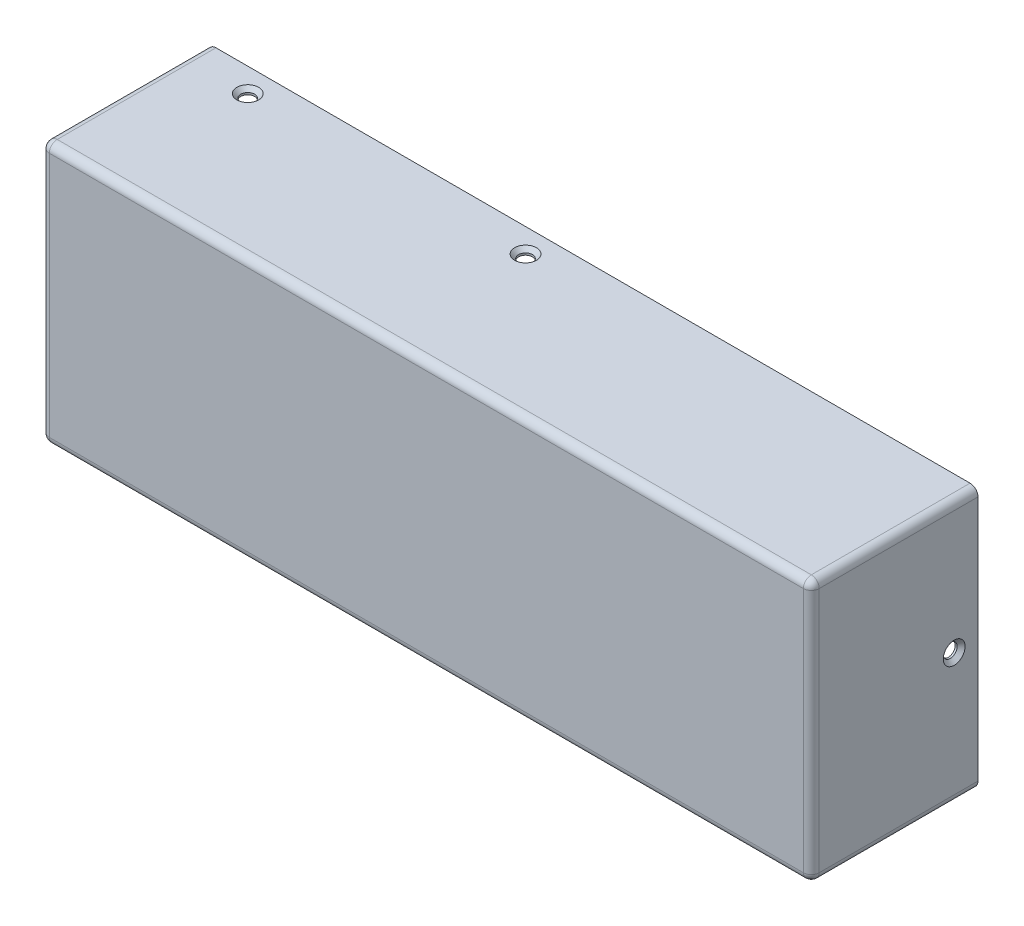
ISO-10303-21;
HEADER;
FILE_DESCRIPTION(('STEP AP214'),'2;1');
FILE_NAME('part.step','',(''),(''),'','','');
FILE_SCHEMA(('AUTOMOTIVE_DESIGN { 1 0 10303 214 1 1 1 1 }'));
ENDSEC;
DATA;
#1=APPLICATION_CONTEXT('core data for automotive mechanical design processes');
#2=APPLICATION_PROTOCOL_DEFINITION('international standard','automotive_design',2000,#1);
#3=PRODUCT_CONTEXT('',#1,'mechanical');
#4=PRODUCT('Part','Part','',(#3));
#5=PRODUCT_RELATED_PRODUCT_CATEGORY('part','',(#4));
#6=PRODUCT_DEFINITION_FORMATION('','',#4);
#7=PRODUCT_DEFINITION_CONTEXT('part definition',#1,'design');
#8=PRODUCT_DEFINITION('design','',#6,#7);
#9=PRODUCT_DEFINITION_SHAPE('','',#8);
#10=(LENGTH_UNIT() NAMED_UNIT(*) SI_UNIT(.MILLI.,.METRE.));
#11=(NAMED_UNIT(*) PLANE_ANGLE_UNIT() SI_UNIT($,.RADIAN.));
#12=(NAMED_UNIT(*) SI_UNIT($,.STERADIAN.) SOLID_ANGLE_UNIT());
#13=UNCERTAINTY_MEASURE_WITH_UNIT(LENGTH_MEASURE(1.E-05),#10,'distance_accuracy_value','');
#14=(GEOMETRIC_REPRESENTATION_CONTEXT(3) GLOBAL_UNCERTAINTY_ASSIGNED_CONTEXT((#13)) GLOBAL_UNIT_ASSIGNED_CONTEXT((#10,
#11,#12)) REPRESENTATION_CONTEXT('',''));
#15=CARTESIAN_POINT('',(0.,0.,0.));
#16=DIRECTION('',(0.,0.,1.));
#17=DIRECTION('',(1.,0.,0.));
#18=AXIS2_PLACEMENT_3D('',#15,#16,#17);
#19=CARTESIAN_POINT('',(46.8344074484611,55.7007394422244,39.9999999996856));
#20=DIRECTION('',(0.,-1.,0.));
#21=DIRECTION('',(0.,0.,-1.));
#22=AXIS2_PLACEMENT_3D('',#19,#20,#21);
#23=CIRCLE('',#22,0.5);
#24=TRIMMED_CURVE('',#23,(PARAMETER_VALUE(1.07767927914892E-09)),
(PARAMETER_VALUE(3.14159265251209)),.T.,.PARAMETER.);
#25=CARTESIAN_POINT('',(46.834407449,55.700739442,40.));
#26=DIRECTION('',(0.,0.,1.));
#27=AXIS1_PLACEMENT('',#25,#26);
#28=SURFACE_OF_REVOLUTION('',#24,#27);
#29=CARTESIAN_POINT('',(46.834407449,55.700739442,40.));
#30=DIRECTION('',(1.,0.,0.));
#31=DIRECTION('',(0.,0.,-1.));
#32=AXIS2_PLACEMENT_3D('',#29,#30,#31);
#33=CIRCLE('',#32,0.5);
#34=CARTESIAN_POINT('',(46.834407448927,55.7007394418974,40.5));
#35=VERTEX_POINT('',#34);
#36=CARTESIAN_POINT('',(46.834407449,56.200739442,40.0000000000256));
#37=VERTEX_POINT('',#36);
#38=EDGE_CURVE('E164',#35,#37,#33,.F.);
#39=ORIENTED_EDGE('',*,*,#38,.F.);
#40=CARTESIAN_POINT('',(46.834407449,55.700739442,40.));
#41=DIRECTION('',(0.,1.,0.));
#42=DIRECTION('',(0.,0.,1.));
#43=AXIS2_PLACEMENT_3D('',#40,#41,#42);
#44=CIRCLE('',#43,0.5);
#45=CARTESIAN_POINT('',(46.334407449,55.700739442,40.));
#46=VERTEX_POINT('',#45);
#47=EDGE_CURVE('E580',#46,#35,#44,.T.);
#48=ORIENTED_EDGE('',*,*,#47,.F.);
#49=CARTESIAN_POINT('',(46.834407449,55.700739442,40.));
#50=DIRECTION('',(0.,0.,-1.));
#51=DIRECTION('',(-1.,0.,0.));
#52=AXIS2_PLACEMENT_3D('',#49,#50,#51);
#53=CIRCLE('',#52,0.5);
#54=EDGE_CURVE('E163',#37,#46,#53,.F.);
#55=ORIENTED_EDGE('',*,*,#54,.F.);
#56=EDGE_LOOP('',(#39,#48,#55));
#57=FACE_BOUND('',#56,.T.);
#58=ADVANCED_FACE('F17',(#57),#28,.F.);
#59=CARTESIAN_POINT('',(46.8344074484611,-6.2992605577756,39.9999999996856));
#60=DIRECTION('',(0.,-1.,0.));
#61=DIRECTION('',(0.,0.,-1.));
#62=AXIS2_PLACEMENT_3D('',#59,#60,#61);
#63=CIRCLE('',#62,0.5);
#64=TRIMMED_CURVE('',#63,(PARAMETER_VALUE(1.07765174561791E-09)),
(PARAMETER_VALUE(3.14159265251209)),.T.,.PARAMETER.);
#65=CARTESIAN_POINT('',(46.834407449,-6.299260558,40.));
#66=DIRECTION('',(0.,0.,1.));
#67=AXIS1_PLACEMENT('',#65,#66);
#68=SURFACE_OF_REVOLUTION('',#64,#67);
#69=CARTESIAN_POINT('',(46.834407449,-6.299260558,40.));
#70=DIRECTION('',(0.,1.,0.));
#71=DIRECTION('',(0.,0.,1.));
#72=AXIS2_PLACEMENT_3D('',#69,#70,#71);
#73=CIRCLE('',#72,0.5);
#74=CARTESIAN_POINT('',(46.8344074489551,-6.2992605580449,40.5));
#75=VERTEX_POINT('',#74);
#76=CARTESIAN_POINT('',(46.334407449,-6.29926055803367,39.9999999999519));
#77=VERTEX_POINT('',#76);
#78=EDGE_CURVE('E578',#75,#77,#73,.F.);
#79=ORIENTED_EDGE('',*,*,#78,.F.);
#80=CARTESIAN_POINT('',(46.834407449,-6.299260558,40.));
#81=DIRECTION('',(-1.,0.,0.));
#82=DIRECTION('',(0.,0.,1.));
#83=AXIS2_PLACEMENT_3D('',#80,#81,#82);
#84=CIRCLE('',#83,0.5);
#85=CARTESIAN_POINT('',(46.834407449,-6.799260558,39.9999999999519));
#86=VERTEX_POINT('',#85);
#87=EDGE_CURVE('E407',#86,#75,#84,.T.);
#88=ORIENTED_EDGE('',*,*,#87,.F.);
#89=CARTESIAN_POINT('',(46.834407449,-6.299260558,40.));
#90=DIRECTION('',(0.,0.,-1.));
#91=DIRECTION('',(-1.,0.,0.));
#92=AXIS2_PLACEMENT_3D('',#89,#90,#91);
#93=CIRCLE('',#92,0.5);
#94=EDGE_CURVE('E401',#77,#86,#93,.F.);
#95=ORIENTED_EDGE('',*,*,#94,.F.);
#96=EDGE_LOOP('',(#79,#88,#95));
#97=FACE_BOUND('',#96,.T.);
#98=ADVANCED_FACE('F383',(#97),#68,.F.);
#99=CARTESIAN_POINT('',(46.834407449,-6.299260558,40.5));
#100=DIRECTION('',(0.,0.,1.));
#101=DIRECTION('',(1.,0.,0.));
#102=AXIS2_PLACEMENT_3D('',#99,#100,#101);
#103=PLANE('',#102);
#104=DIRECTION('',(-1.,0.,0.));
#105=VECTOR('',#104,1.);
#106=CARTESIAN_POINT('',(141.834407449,-6.29926055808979,40.5));
#107=LINE('',#106,#105);
#108=CARTESIAN_POINT('',(236.834407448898,-6.2992605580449,40.5));
#109=VERTEX_POINT('',#108);
#110=EDGE_CURVE('E404',#75,#109,#107,.F.);
#111=ORIENTED_EDGE('',*,*,#110,.F.);
#112=DIRECTION('',(0.,1.,0.));
#113=VECTOR('',#112,1.);
#114=CARTESIAN_POINT('',(46.8344074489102,24.700739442,40.5));
#115=LINE('',#114,#113);
#116=EDGE_CURVE('E582',#35,#75,#115,.F.);
#117=ORIENTED_EDGE('',*,*,#116,.F.);
#118=DIRECTION('',(1.,0.,0.));
#119=VECTOR('',#118,1.);
#120=CARTESIAN_POINT('',(141.834407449,55.7007394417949,40.5));
#121=LINE('',#120,#119);
#122=CARTESIAN_POINT('',(236.834407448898,55.7007394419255,40.5));
#123=VERTEX_POINT('',#122);
#124=EDGE_CURVE('E418',#123,#35,#121,.F.);
#125=ORIENTED_EDGE('',*,*,#124,.F.);
#126=DIRECTION('',(0.,-1.,0.));
#127=VECTOR('',#126,1.);
#128=CARTESIAN_POINT('',(236.834407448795,24.700739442,40.5));
#129=LINE('',#128,#127);
#130=EDGE_CURVE('E388',#109,#123,#129,.F.);
#131=ORIENTED_EDGE('',*,*,#130,.F.);
#132=EDGE_LOOP('',(#111,#117,#125,#131));
#133=FACE_BOUND('',#132,.T.);
#134=ADVANCED_FACE('F381',(#133),#103,.F.);
#135=CARTESIAN_POINT('',(236.834407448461,55.7007394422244,39.9999999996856));
#136=DIRECTION('',(0.,-1.,0.));
#137=DIRECTION('',(0.,0.,-1.));
#138=AXIS2_PLACEMENT_3D('',#135,#136,#137);
#139=CIRCLE('',#138,0.5);
#140=TRIMMED_CURVE('',#139,(PARAMETER_VALUE(1.07747144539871E-09)),
(PARAMETER_VALUE(3.14159265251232)),.T.,.PARAMETER.);
#141=CARTESIAN_POINT('',(236.834407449,55.700739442,40.));
#142=DIRECTION('',(0.,0.,1.));
#143=AXIS1_PLACEMENT('',#141,#142);
#144=SURFACE_OF_REVOLUTION('',#140,#143);
#145=CARTESIAN_POINT('',(236.834407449,55.700739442,40.));
#146=DIRECTION('',(1.,0.,0.));
#147=DIRECTION('',(0.,0.,-1.));
#148=AXIS2_PLACEMENT_3D('',#145,#146,#147);
#149=CIRCLE('',#148,0.5);
#150=CARTESIAN_POINT('',(236.834407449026,56.200739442,40.));
#151=VERTEX_POINT('',#150);
#152=EDGE_CURVE('E568',#151,#123,#149,.T.);
#153=ORIENTED_EDGE('',*,*,#152,.F.);
#154=CARTESIAN_POINT('',(236.834407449,55.700739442,40.));
#155=DIRECTION('',(0.,0.,-1.));
#156=DIRECTION('',(-1.,0.,0.));
#157=AXIS2_PLACEMENT_3D('',#154,#155,#156);
#158=CIRCLE('',#157,0.5);
#159=CARTESIAN_POINT('',(237.334407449,55.700739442,40.0000000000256));
#160=VERTEX_POINT('',#159);
#161=EDGE_CURVE('E543',#160,#151,#158,.F.);
#162=ORIENTED_EDGE('',*,*,#161,.F.);
#163=CARTESIAN_POINT('',(236.834407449,55.700739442,40.));
#164=DIRECTION('',(0.,-1.,0.));
#165=DIRECTION('',(0.,0.,-1.));
#166=AXIS2_PLACEMENT_3D('',#163,#164,#165);
#167=CIRCLE('',#166,0.5);
#168=EDGE_CURVE('E391',#123,#160,#167,.F.);
#169=ORIENTED_EDGE('',*,*,#168,.F.);
#170=EDGE_LOOP('',(#153,#162,#169));
#171=FACE_BOUND('',#170,.T.);
#172=ADVANCED_FACE('F377',(#171),#144,.F.);
#173=CARTESIAN_POINT('',(236.834407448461,-6.29926055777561,39.9999999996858));
#174=DIRECTION('',(0.,-1.,0.));
#175=DIRECTION('',(0.,0.,-1.));
#176=AXIS2_PLACEMENT_3D('',#173,#174,#175);
#177=CIRCLE('',#176,0.5);
#178=TRIMMED_CURVE('',#177,(PARAMETER_VALUE(1.07747144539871E-09)),
(PARAMETER_VALUE(3.14159265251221)),.T.,.PARAMETER.);
#179=CARTESIAN_POINT('',(236.834407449,-6.299260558,40.));
#180=DIRECTION('',(0.,0.,1.));
#181=AXIS1_PLACEMENT('',#179,#180);
#182=SURFACE_OF_REVOLUTION('',#178,#181);
#183=CARTESIAN_POINT('',(236.834407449,-6.299260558,40.));
#184=DIRECTION('',(0.,-1.,0.));
#185=DIRECTION('',(0.,0.,-1.));
#186=AXIS2_PLACEMENT_3D('',#183,#184,#185);
#187=CIRCLE('',#186,0.5);
#188=CARTESIAN_POINT('',(237.334407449,-6.299260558,40.0000000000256));
#189=VERTEX_POINT('',#188);
#190=EDGE_CURVE('E392',#189,#109,#187,.T.);
#191=ORIENTED_EDGE('',*,*,#190,.F.);
#192=CARTESIAN_POINT('',(236.834407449,-6.299260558,40.));
#193=DIRECTION('',(0.,0.,-1.));
#194=DIRECTION('',(-1.,0.,0.));
#195=AXIS2_PLACEMENT_3D('',#192,#193,#194);
#196=CIRCLE('',#195,0.5);
#197=CARTESIAN_POINT('',(236.834407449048,-6.799260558,39.9999999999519));
#198=VERTEX_POINT('',#197);
#199=EDGE_CURVE('E542',#198,#189,#196,.F.);
#200=ORIENTED_EDGE('',*,*,#199,.F.);
#201=CARTESIAN_POINT('',(236.834407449,-6.299260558,40.));
#202=DIRECTION('',(-1.,0.,0.));
#203=DIRECTION('',(0.,0.,1.));
#204=AXIS2_PLACEMENT_3D('',#201,#202,#203);
#205=CIRCLE('',#204,0.5);
#206=EDGE_CURVE('E406',#109,#198,#205,.F.);
#207=ORIENTED_EDGE('',*,*,#206,.F.);
#208=EDGE_LOOP('',(#191,#200,#207));
#209=FACE_BOUND('',#208,.T.);
#210=ADVANCED_FACE('F373',(#209),#182,.F.);
#211=CARTESIAN_POINT('',(130.834407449,56.700739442,6.));
#212=DIRECTION('',(0.,1.,0.));
#213=DIRECTION('',(0.,0.,1.));
#214=AXIS2_PLACEMENT_3D('',#211,#212,#213);
#215=CONICAL_SURFACE('',#214,1.75,0.785398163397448);
#216=CARTESIAN_POINT('',(130.834407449,57.7007394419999,6.));
#217=DIRECTION('',(0.,1.,0.));
#218=DIRECTION('',(0.,0.,1.));
#219=AXIS2_PLACEMENT_3D('',#216,#217,#218);
#220=CIRCLE('',#219,2.74999999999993);
#221=CARTESIAN_POINT('',(130.834407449,57.7007394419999,8.74999999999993));
#222=VERTEX_POINT('',#221);
#223=EDGE_CURVE('E536',#222,#222,#220,.T.);
#224=ORIENTED_EDGE('',*,*,#223,.T.);
#225=EDGE_LOOP('',(#224));
#226=FACE_BOUND('',#225,.T.);
#227=CARTESIAN_POINT('',(130.834407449,56.700739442,6.));
#228=DIRECTION('',(0.,1.,0.));
#229=DIRECTION('',(0.,0.,1.));
#230=AXIS2_PLACEMENT_3D('',#227,#228,#229);
#231=CIRCLE('',#230,1.75);
#232=CARTESIAN_POINT('',(130.834407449,56.700739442,7.75));
#233=VERTEX_POINT('',#232);
#234=EDGE_CURVE('E413',#233,#233,#231,.T.);
#235=ORIENTED_EDGE('',*,*,#234,.F.);
#236=EDGE_LOOP('',(#235));
#237=FACE_BOUND('',#236,.T.);
#238=ADVANCED_FACE('F369',(#226,#237),#215,.F.);
#239=CARTESIAN_POINT('',(60.834407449,56.700739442,6.));
#240=DIRECTION('',(0.,1.,0.));
#241=DIRECTION('',(0.,0.,1.));
#242=AXIS2_PLACEMENT_3D('',#239,#240,#241);
#243=CONICAL_SURFACE('',#242,1.75,0.785398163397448);
#244=CARTESIAN_POINT('',(60.834407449,57.7007394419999,6.));
#245=DIRECTION('',(0.,1.,0.));
#246=DIRECTION('',(0.,0.,1.));
#247=AXIS2_PLACEMENT_3D('',#244,#245,#246);
#248=CIRCLE('',#247,2.74999999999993);
#249=CARTESIAN_POINT('',(60.834407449,57.7007394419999,8.74999999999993));
#250=VERTEX_POINT('',#249);
#251=EDGE_CURVE('E533',#250,#250,#248,.T.);
#252=ORIENTED_EDGE('',*,*,#251,.T.);
#253=EDGE_LOOP('',(#252));
#254=FACE_BOUND('',#253,.T.);
#255=CARTESIAN_POINT('',(60.834407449,56.700739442,6.));
#256=DIRECTION('',(0.,1.,0.));
#257=DIRECTION('',(0.,0.,1.));
#258=AXIS2_PLACEMENT_3D('',#255,#256,#257);
#259=CIRCLE('',#258,1.75);
#260=CARTESIAN_POINT('',(60.834407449,56.700739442,7.75));
#261=VERTEX_POINT('',#260);
#262=EDGE_CURVE('E410',#261,#261,#259,.T.);
#263=ORIENTED_EDGE('',*,*,#262,.F.);
#264=EDGE_LOOP('',(#263));
#265=FACE_BOUND('',#264,.T.);
#266=ADVANCED_FACE('F365',(#254,#265),#243,.F.);
#267=CARTESIAN_POINT('',(46.8344074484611,55.7007394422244,39.9999999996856));
#268=DIRECTION('',(0.,0.,1.));
#269=DIRECTION('',(-1.,0.,0.));
#270=AXIS2_PLACEMENT_3D('',#267,#268,#269);
#271=SPHERICAL_SURFACE('',#270,2.);
#272=CARTESIAN_POINT('',(46.834407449,55.700739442,40.));
#273=DIRECTION('',(0.,1.,0.));
#274=DIRECTION('',(0.,0.,1.));
#275=AXIS2_PLACEMENT_3D('',#272,#273,#274);
#276=CIRCLE('',#275,2.);
#277=CARTESIAN_POINT('',(44.834407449,55.700739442,39.9999999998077));
#278=VERTEX_POINT('',#277);
#279=CARTESIAN_POINT('',(46.834407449,55.7007394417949,42.));
#280=VERTEX_POINT('',#279);
#281=EDGE_CURVE('E398',#278,#280,#276,.T.);
#282=ORIENTED_EDGE('',*,*,#281,.T.);
#283=CARTESIAN_POINT('',(46.834407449,55.700739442,40.));
#284=DIRECTION('',(1.,0.,0.));
#285=DIRECTION('',(0.,0.,-1.));
#286=AXIS2_PLACEMENT_3D('',#283,#284,#285);
#287=CIRCLE('',#286,2.);
#288=CARTESIAN_POINT('',(46.8344074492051,57.700739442,40.0000000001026));
#289=VERTEX_POINT('',#288);
#290=EDGE_CURVE('E656',#280,#289,#287,.F.);
#291=ORIENTED_EDGE('',*,*,#290,.T.);
#292=CARTESIAN_POINT('',(46.834407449,55.700739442,40.));
#293=DIRECTION('',(0.,0.,-1.));
#294=DIRECTION('',(-1.,0.,0.));
#295=AXIS2_PLACEMENT_3D('',#292,#293,#294);
#296=CIRCLE('',#295,2.);
#297=EDGE_CURVE('E352',#289,#278,#296,.F.);
#298=ORIENTED_EDGE('',*,*,#297,.T.);
#299=EDGE_LOOP('',(#282,#291,#298));
#300=FACE_BOUND('',#299,.T.);
#301=ADVANCED_FACE('F362',(#300),#271,.T.);
#302=CARTESIAN_POINT('',(45.834407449,24.700739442,6.));
#303=DIRECTION('',(-1.,0.,0.));
#304=DIRECTION('',(0.,-1.,0.));
#305=AXIS2_PLACEMENT_3D('',#302,#303,#304);
#306=CONICAL_SURFACE('',#305,1.75,0.785398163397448);
#307=CARTESIAN_POINT('',(44.834407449,24.700739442,6.));
#308=DIRECTION('',(-1.,0.,0.));
#309=DIRECTION('',(0.,-1.,0.));
#310=AXIS2_PLACEMENT_3D('',#307,#308,#309);
#311=CIRCLE('',#310,2.74999999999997);
#312=CARTESIAN_POINT('',(44.834407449,21.950739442,6.));
#313=VERTEX_POINT('',#312);
#314=EDGE_CURVE('E348',#313,#313,#311,.T.);
#315=ORIENTED_EDGE('',*,*,#314,.T.);
#316=EDGE_LOOP('',(#315));
#317=FACE_BOUND('',#316,.T.);
#318=CARTESIAN_POINT('',(45.834407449,24.700739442,6.));
#319=DIRECTION('',(1.,0.,0.));
#320=DIRECTION('',(0.,0.,-1.));
#321=AXIS2_PLACEMENT_3D('',#318,#319,#320);
#322=CIRCLE('',#321,1.75);
#323=CARTESIAN_POINT('',(45.834407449,24.700739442,4.25));
#324=VERTEX_POINT('',#323);
#325=EDGE_CURVE('E570',#324,#324,#322,.F.);
#326=ORIENTED_EDGE('',*,*,#325,.F.);
#327=EDGE_LOOP('',(#326));
#328=FACE_BOUND('',#327,.T.);
#329=ADVANCED_FACE('F337',(#317,#328),#306,.F.);
#330=CARTESIAN_POINT('',(46.8344074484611,-6.2992605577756,39.9999999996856));
#331=DIRECTION('',(0.,0.,1.));
#332=DIRECTION('',(-1.,0.,0.));
#333=AXIS2_PLACEMENT_3D('',#330,#331,#332);
#334=SPHERICAL_SURFACE('',#333,2.);
#335=CARTESIAN_POINT('',(46.834407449,-6.299260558,40.));
#336=DIRECTION('',(-1.,0.,0.));
#337=DIRECTION('',(0.,0.,1.));
#338=AXIS2_PLACEMENT_3D('',#335,#336,#337);
#339=CIRCLE('',#338,2.);
#340=CARTESIAN_POINT('',(46.8344074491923,-8.299260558,39.9999999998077));
#341=VERTEX_POINT('',#340);
#342=CARTESIAN_POINT('',(46.8344074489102,-6.299260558,42.));
#343=VERTEX_POINT('',#342);
#344=EDGE_CURVE('E648',#341,#343,#339,.T.);
#345=ORIENTED_EDGE('',*,*,#344,.T.);
#346=CARTESIAN_POINT('',(46.834407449,-6.299260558,40.));
#347=DIRECTION('',(0.,1.,0.));
#348=DIRECTION('',(0.,0.,1.));
#349=AXIS2_PLACEMENT_3D('',#346,#347,#348);
#350=CIRCLE('',#349,2.);
#351=CARTESIAN_POINT('',(44.834407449,-6.29926055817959,39.9999999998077));
#352=VERTEX_POINT('',#351);
#353=EDGE_CURVE('E665',#343,#352,#350,.F.);
#354=ORIENTED_EDGE('',*,*,#353,.T.);
#355=CARTESIAN_POINT('',(46.834407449,-6.299260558,40.));
#356=DIRECTION('',(0.,0.,-1.));
#357=DIRECTION('',(-1.,0.,0.));
#358=AXIS2_PLACEMENT_3D('',#355,#356,#357);
#359=CIRCLE('',#358,2.);
#360=EDGE_CURVE('E609',#352,#341,#359,.F.);
#361=ORIENTED_EDGE('',*,*,#360,.T.);
#362=EDGE_LOOP('',(#345,#354,#361));
#363=FACE_BOUND('',#362,.T.);
#364=ADVANCED_FACE('F332',(#363),#334,.T.);
#365=CARTESIAN_POINT('',(46.834407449,-6.299260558,40.));
#366=DIRECTION('',(0.,1.,0.));
#367=DIRECTION('',(0.,0.,1.));
#368=AXIS2_PLACEMENT_3D('',#365,#366,#367);
#369=CYLINDRICAL_SURFACE('',#368,0.5);
#370=ORIENTED_EDGE('',*,*,#47,.T.);
#371=ORIENTED_EDGE('',*,*,#116,.T.);
#372=ORIENTED_EDGE('',*,*,#78,.T.);
#373=DIRECTION('',(0.,-1.,0.));
#374=VECTOR('',#373,1.);
#375=CARTESIAN_POINT('',(46.334407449,24.700739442,40.));
#376=LINE('',#375,#374);
#377=EDGE_CURVE('E573',#46,#77,#376,.T.);
#378=ORIENTED_EDGE('',*,*,#377,.F.);
#379=EDGE_LOOP('',(#370,#371,#372,#378));
#380=FACE_BOUND('',#379,.T.);
#381=ADVANCED_FACE('F328',(#380),#369,.F.);
#382=CARTESIAN_POINT('',(45.834407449,24.700739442,6.));
#383=DIRECTION('',(1.,0.,0.));
#384=DIRECTION('',(0.,1.,0.));
#385=AXIS2_PLACEMENT_3D('',#382,#383,#384);
#386=CYLINDRICAL_SURFACE('',#385,1.75);
#387=CARTESIAN_POINT('',(46.334407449,24.700739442,6.));
#388=DIRECTION('',(1.,0.,0.));
#389=DIRECTION('',(0.,1.,0.));
#390=AXIS2_PLACEMENT_3D('',#387,#388,#389);
#391=CIRCLE('',#390,1.75);
#392=CARTESIAN_POINT('',(46.334407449,26.450739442,6.));
#393=VERTEX_POINT('',#392);
#394=EDGE_CURVE('E525',#393,#393,#391,.F.);
#395=ORIENTED_EDGE('',*,*,#394,.F.);
#396=EDGE_LOOP('',(#395));
#397=FACE_BOUND('',#396,.T.);
#398=ORIENTED_EDGE('',*,*,#325,.T.);
#399=EDGE_LOOP('',(#398));
#400=FACE_BOUND('',#399,.T.);
#401=ADVANCED_FACE('F324',(#397,#400),#386,.F.);
#402=CARTESIAN_POINT('',(46.834407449,55.700739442,40.));
#403=DIRECTION('',(1.,0.,0.));
#404=DIRECTION('',(0.,0.,-1.));
#405=AXIS2_PLACEMENT_3D('',#402,#403,#404);
#406=CYLINDRICAL_SURFACE('',#405,0.5);
#407=ORIENTED_EDGE('',*,*,#38,.T.);
#408=DIRECTION('',(-1.,0.,0.));
#409=VECTOR('',#408,1.);
#410=CARTESIAN_POINT('',(141.834407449,56.200739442,40.));
#411=LINE('',#410,#409);
#412=EDGE_CURVE('E172',#151,#37,#411,.T.);
#413=ORIENTED_EDGE('',*,*,#412,.F.);
#414=ORIENTED_EDGE('',*,*,#152,.T.);
#415=ORIENTED_EDGE('',*,*,#124,.T.);
#416=EDGE_LOOP('',(#407,#413,#414,#415));
#417=FACE_BOUND('',#416,.T.);
#418=ADVANCED_FACE('F321',(#417),#406,.F.);
#419=CARTESIAN_POINT('',(46.834407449,55.700739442,40.));
#420=DIRECTION('',(0.,0.,-1.));
#421=DIRECTION('',(0.,1.,0.));
#422=AXIS2_PLACEMENT_3D('',#419,#420,#421);
#423=CYLINDRICAL_SURFACE('',#422,0.5);
#424=ORIENTED_EDGE('',*,*,#54,.T.);
#425=DIRECTION('',(0.,0.,1.));
#426=VECTOR('',#425,1.);
#427=CARTESIAN_POINT('',(46.334407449,55.700739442,20.));
#428=LINE('',#427,#426);
#429=CARTESIAN_POINT('',(46.334407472,55.7007394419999,0.));
#430=VERTEX_POINT('',#429);
#431=EDGE_CURVE('E161',#430,#46,#428,.T.);
#432=ORIENTED_EDGE('',*,*,#431,.F.);
#433=CARTESIAN_POINT('',(46.834407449,55.7007394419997,0.));
#434=DIRECTION('',(0.,0.,-1.));
#435=DIRECTION('',(0.,1.,0.));
#436=AXIS2_PLACEMENT_3D('',#433,#434,#435);
#437=CIRCLE('',#436,0.5);
#438=CARTESIAN_POINT('',(46.834407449,56.200739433,0.));
#439=VERTEX_POINT('',#438);
#440=EDGE_CURVE('E21',#430,#439,#437,.T.);
#441=ORIENTED_EDGE('',*,*,#440,.T.);
#442=DIRECTION('',(0.,0.,-1.));
#443=VECTOR('',#442,1.);
#444=CARTESIAN_POINT('',(46.834407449,56.200739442,20.));
#445=LINE('',#444,#443);
#446=EDGE_CURVE('E159',#37,#439,#445,.T.);
#447=ORIENTED_EDGE('',*,*,#446,.F.);
#448=EDGE_LOOP('',(#424,#432,#441,#447));
#449=FACE_BOUND('',#448,.T.);
#450=ADVANCED_FACE('F158',(#449),#423,.F.);
#451=CARTESIAN_POINT('',(130.834407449,56.200739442,6.));
#452=DIRECTION('',(0.,1.,0.));
#453=DIRECTION('',(-1.,0.,0.));
#454=AXIS2_PLACEMENT_3D('',#451,#452,#453);
#455=CYLINDRICAL_SURFACE('',#454,1.75);
#456=CARTESIAN_POINT('',(130.834407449,56.200739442,6.));
#457=DIRECTION('',(0.,1.,0.));
#458=DIRECTION('',(-1.,0.,0.));
#459=AXIS2_PLACEMENT_3D('',#456,#457,#458);
#460=CIRCLE('',#459,1.75);
#461=CARTESIAN_POINT('',(129.084407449,56.200739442,6.));
#462=VERTEX_POINT('',#461);
#463=EDGE_CURVE('E174',#462,#462,#460,.T.);
#464=ORIENTED_EDGE('',*,*,#463,.F.);
#465=EDGE_LOOP('',(#464));
#466=FACE_BOUND('',#465,.T.);
#467=ORIENTED_EDGE('',*,*,#234,.T.);
#468=EDGE_LOOP('',(#467));
#469=FACE_BOUND('',#468,.T.);
#470=ADVANCED_FACE('F314',(#466,#469),#455,.F.);
#471=CARTESIAN_POINT('',(60.834407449,56.200739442,6.));
#472=DIRECTION('',(0.,1.,0.));
#473=DIRECTION('',(-1.,0.,0.));
#474=AXIS2_PLACEMENT_3D('',#471,#472,#473);
#475=CYLINDRICAL_SURFACE('',#474,1.75);
#476=CARTESIAN_POINT('',(60.834407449,56.200739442,6.));
#477=DIRECTION('',(0.,1.,0.));
#478=DIRECTION('',(-1.,0.,0.));
#479=AXIS2_PLACEMENT_3D('',#476,#477,#478);
#480=CIRCLE('',#479,1.75);
#481=CARTESIAN_POINT('',(59.084407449,56.200739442,6.));
#482=VERTEX_POINT('',#481);
#483=EDGE_CURVE('E519',#482,#482,#480,.T.);
#484=ORIENTED_EDGE('',*,*,#483,.F.);
#485=EDGE_LOOP('',(#484));
#486=FACE_BOUND('',#485,.T.);
#487=ORIENTED_EDGE('',*,*,#262,.T.);
#488=EDGE_LOOP('',(#487));
#489=FACE_BOUND('',#488,.T.);
#490=ADVANCED_FACE('F310',(#486,#489),#475,.F.);
#491=CARTESIAN_POINT('',(236.834407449,-6.299260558,40.));
#492=DIRECTION('',(-1.,0.,0.));
#493=DIRECTION('',(0.,0.,1.));
#494=AXIS2_PLACEMENT_3D('',#491,#492,#493);
#495=CYLINDRICAL_SURFACE('',#494,0.5);
#496=ORIENTED_EDGE('',*,*,#206,.T.);
#497=DIRECTION('',(1.,0.,0.));
#498=VECTOR('',#497,1.);
#499=CARTESIAN_POINT('',(141.834407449,-6.799260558,40.));
#500=LINE('',#499,#498);
#501=EDGE_CURVE('E522',#86,#198,#500,.T.);
#502=ORIENTED_EDGE('',*,*,#501,.F.);
#503=ORIENTED_EDGE('',*,*,#87,.T.);
#504=ORIENTED_EDGE('',*,*,#110,.T.);
#505=EDGE_LOOP('',(#496,#502,#503,#504));
#506=FACE_BOUND('',#505,.T.);
#507=ADVANCED_FACE('F306',(#506),#495,.F.);
#508=CARTESIAN_POINT('',(46.834407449,-6.299260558,40.));
#509=DIRECTION('',(0.,0.,-1.));
#510=DIRECTION('',(0.,1.,0.));
#511=AXIS2_PLACEMENT_3D('',#508,#509,#510);
#512=CYLINDRICAL_SURFACE('',#511,0.5);
#513=ORIENTED_EDGE('',*,*,#94,.T.);
#514=DIRECTION('',(0.,0.,1.));
#515=VECTOR('',#514,1.);
#516=CARTESIAN_POINT('',(46.834407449,-6.799260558,20.));
#517=LINE('',#516,#515);
#518=CARTESIAN_POINT('',(46.834407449,-6.799260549,0.));
#519=VERTEX_POINT('',#518);
#520=EDGE_CURVE('E518',#519,#86,#517,.T.);
#521=ORIENTED_EDGE('',*,*,#520,.F.);
#522=CARTESIAN_POINT('',(46.834407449,-6.29926055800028,0.));
#523=DIRECTION('',(0.,0.,-1.));
#524=DIRECTION('',(0.,1.,0.));
#525=AXIS2_PLACEMENT_3D('',#522,#523,#524);
#526=CIRCLE('',#525,0.5);
#527=CARTESIAN_POINT('',(46.334407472,-6.29926055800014,0.));
#528=VERTEX_POINT('',#527);
#529=EDGE_CURVE('E544',#519,#528,#526,.T.);
#530=ORIENTED_EDGE('',*,*,#529,.T.);
#531=DIRECTION('',(0.,0.,-1.));
#532=VECTOR('',#531,1.);
#533=CARTESIAN_POINT('',(46.334407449,-6.299260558,20.));
#534=LINE('',#533,#532);
#535=EDGE_CURVE('E529',#77,#528,#534,.T.);
#536=ORIENTED_EDGE('',*,*,#535,.F.);
#537=EDGE_LOOP('',(#513,#521,#530,#536));
#538=FACE_BOUND('',#537,.T.);
#539=ADVANCED_FACE('F302',(#538),#512,.F.);
#540=CARTESIAN_POINT('',(130.834407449,-7.299260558,6.));
#541=DIRECTION('',(0.,1.,0.));
#542=DIRECTION('',(-1.,0.,0.));
#543=AXIS2_PLACEMENT_3D('',#540,#541,#542);
#544=CYLINDRICAL_SURFACE('',#543,1.75);
#545=CARTESIAN_POINT('',(130.834407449,-6.799260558,6.));
#546=DIRECTION('',(0.,1.,0.));
#547=DIRECTION('',(-1.,0.,0.));
#548=AXIS2_PLACEMENT_3D('',#545,#546,#547);
#549=CIRCLE('',#548,1.75);
#550=CARTESIAN_POINT('',(129.084407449,-6.799260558,6.));
#551=VERTEX_POINT('',#550);
#552=EDGE_CURVE('E515',#551,#551,#549,.F.);
#553=ORIENTED_EDGE('',*,*,#552,.F.);
#554=EDGE_LOOP('',(#553));
#555=FACE_BOUND('',#554,.T.);
#556=CARTESIAN_POINT('',(130.834407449,-7.29926055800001,6.));
#557=DIRECTION('',(0.,-1.,0.));
#558=DIRECTION('',(0.,0.,-1.));
#559=AXIS2_PLACEMENT_3D('',#556,#557,#558);
#560=CIRCLE('',#559,1.75);
#561=CARTESIAN_POINT('',(130.834407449,-7.299260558,4.25));
#562=VERTEX_POINT('',#561);
#563=EDGE_CURVE('E399',#562,#562,#560,.F.);
#564=ORIENTED_EDGE('',*,*,#563,.F.);
#565=EDGE_LOOP('',(#564));
#566=FACE_BOUND('',#565,.T.);
#567=ADVANCED_FACE('F298',(#555,#566),#544,.F.);
#568=CARTESIAN_POINT('',(60.834407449,-7.299260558,6.));
#569=DIRECTION('',(0.,1.,0.));
#570=DIRECTION('',(-1.,0.,0.));
#571=AXIS2_PLACEMENT_3D('',#568,#569,#570);
#572=CYLINDRICAL_SURFACE('',#571,1.75);
#573=CARTESIAN_POINT('',(60.834407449,-6.799260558,6.));
#574=DIRECTION('',(0.,1.,0.));
#575=DIRECTION('',(-1.,0.,0.));
#576=AXIS2_PLACEMENT_3D('',#573,#574,#575);
#577=CIRCLE('',#576,1.75);
#578=CARTESIAN_POINT('',(59.084407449,-6.799260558,6.));
#579=VERTEX_POINT('',#578);
#580=EDGE_CURVE('E511',#579,#579,#577,.F.);
#581=ORIENTED_EDGE('',*,*,#580,.F.);
#582=EDGE_LOOP('',(#581));
#583=FACE_BOUND('',#582,.T.);
#584=CARTESIAN_POINT('',(60.834407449,-7.29926055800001,6.));
#585=DIRECTION('',(0.,-1.,0.));
#586=DIRECTION('',(0.,0.,-1.));
#587=AXIS2_PLACEMENT_3D('',#584,#585,#586);
#588=CIRCLE('',#587,1.75);
#589=CARTESIAN_POINT('',(60.834407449,-7.299260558,4.25));
#590=VERTEX_POINT('',#589);
#591=EDGE_CURVE('E395',#590,#590,#588,.F.);
#592=ORIENTED_EDGE('',*,*,#591,.F.);
#593=EDGE_LOOP('',(#592));
#594=FACE_BOUND('',#593,.T.);
#595=ADVANCED_FACE('F294',(#583,#594),#572,.F.);
#596=CARTESIAN_POINT('',(130.834407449,-7.299260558,6.));
#597=DIRECTION('',(0.,-1.,0.));
#598=DIRECTION('',(1.,0.,0.));
#599=AXIS2_PLACEMENT_3D('',#596,#597,#598);
#600=CONICAL_SURFACE('',#599,1.75,0.785398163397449);
#601=CARTESIAN_POINT('',(130.834407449,-8.2992605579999,6.));
#602=DIRECTION('',(0.,-1.,0.));
#603=DIRECTION('',(1.,0.,0.));
#604=AXIS2_PLACEMENT_3D('',#601,#602,#603);
#605=CIRCLE('',#604,2.7499999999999);
#606=CARTESIAN_POINT('',(133.584407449,-8.2992605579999,6.));
#607=VERTEX_POINT('',#606);
#608=EDGE_CURVE('E507',#607,#607,#605,.T.);
#609=ORIENTED_EDGE('',*,*,#608,.T.);
#610=EDGE_LOOP('',(#609));
#611=FACE_BOUND('',#610,.T.);
#612=ORIENTED_EDGE('',*,*,#563,.T.);
#613=EDGE_LOOP('',(#612));
#614=FACE_BOUND('',#613,.T.);
#615=ADVANCED_FACE('F290',(#611,#614),#600,.F.);
#616=CARTESIAN_POINT('',(60.834407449,-7.299260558,6.));
#617=DIRECTION('',(0.,-1.,0.));
#618=DIRECTION('',(1.,0.,0.));
#619=AXIS2_PLACEMENT_3D('',#616,#617,#618);
#620=CONICAL_SURFACE('',#619,1.75,0.785398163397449);
#621=CARTESIAN_POINT('',(60.834407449,-8.2992605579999,6.));
#622=DIRECTION('',(0.,-1.,0.));
#623=DIRECTION('',(1.,0.,0.));
#624=AXIS2_PLACEMENT_3D('',#621,#622,#623);
#625=CIRCLE('',#624,2.7499999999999);
#626=CARTESIAN_POINT('',(63.5844074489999,-8.2992605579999,6.));
#627=VERTEX_POINT('',#626);
#628=EDGE_CURVE('E503',#627,#627,#625,.T.);
#629=ORIENTED_EDGE('',*,*,#628,.T.);
#630=EDGE_LOOP('',(#629));
#631=FACE_BOUND('',#630,.T.);
#632=ORIENTED_EDGE('',*,*,#591,.T.);
#633=EDGE_LOOP('',(#632));
#634=FACE_BOUND('',#633,.T.);
#635=ADVANCED_FACE('F286',(#631,#634),#620,.F.);
#636=CARTESIAN_POINT('',(46.834407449,-6.299260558,40.));
#637=DIRECTION('',(0.,1.,0.));
#638=DIRECTION('',(0.,0.,1.));
#639=AXIS2_PLACEMENT_3D('',#636,#637,#638);
#640=CYLINDRICAL_SURFACE('',#639,2.);
#641=DIRECTION('',(0.,-1.,0.));
#642=VECTOR('',#641,1.);
#643=CARTESIAN_POINT('',(46.834407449,24.700739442,42.));
#644=LINE('',#643,#642);
#645=EDGE_CURVE('E659',#280,#343,#644,.T.);
#646=ORIENTED_EDGE('',*,*,#645,.F.);
#647=ORIENTED_EDGE('',*,*,#281,.F.);
#648=DIRECTION('',(0.,-1.,0.));
#649=VECTOR('',#648,1.);
#650=CARTESIAN_POINT('',(44.834407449,24.700739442,40.));
#651=LINE('',#650,#649);
#652=EDGE_CURVE('E345',#278,#352,#651,.T.);
#653=ORIENTED_EDGE('',*,*,#652,.T.);
#654=ORIENTED_EDGE('',*,*,#353,.F.);
#655=EDGE_LOOP('',(#646,#647,#653,#654));
#656=FACE_BOUND('',#655,.T.);
#657=ADVANCED_FACE('F282',(#656),#640,.T.);
#658=CARTESIAN_POINT('',(46.834407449,55.700739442,40.));
#659=DIRECTION('',(1.,0.,0.));
#660=DIRECTION('',(0.,0.,-1.));
#661=AXIS2_PLACEMENT_3D('',#658,#659,#660);
#662=CYLINDRICAL_SURFACE('',#661,2.);
#663=DIRECTION('',(-1.,0.,0.));
#664=VECTOR('',#663,1.);
#665=CARTESIAN_POINT('',(141.834407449,57.700739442,40.));
#666=LINE('',#665,#664);
#667=CARTESIAN_POINT('',(236.834407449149,57.7007394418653,39.999999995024));
#668=VERTEX_POINT('',#667);
#669=EDGE_CURVE('E539',#668,#289,#666,.T.);
#670=ORIENTED_EDGE('',*,*,#669,.T.);
#671=ORIENTED_EDGE('',*,*,#290,.F.);
#672=DIRECTION('',(-1.,0.,0.));
#673=VECTOR('',#672,1.);
#674=CARTESIAN_POINT('',(141.834407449,55.700739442,42.));
#675=LINE('',#674,#673);
#676=CARTESIAN_POINT('',(236.834407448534,55.700739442,41.9999999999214));
#677=VERTEX_POINT('',#676);
#678=EDGE_CURVE('E506',#677,#280,#675,.T.);
#679=ORIENTED_EDGE('',*,*,#678,.F.);
#680=CARTESIAN_POINT('',(236.834407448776,55.7007394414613,39.9999999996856));
#681=DIRECTION('',(1.,2.05103206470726E-10,0.));
#682=DIRECTION('',(0.,0.,-1.));
#683=AXIS2_PLACEMENT_3D('',#680,#681,#682);
#684=CIRCLE('',#683,2.);
#685=EDGE_CURVE('E747',#677,#668,#684,.F.);
#686=ORIENTED_EDGE('',*,*,#685,.T.);
#687=EDGE_LOOP('',(#670,#671,#679,#686));
#688=FACE_BOUND('',#687,.T.);
#689=ADVANCED_FACE('F278',(#688),#662,.T.);
#690=CARTESIAN_POINT('',(236.834407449,-6.299260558,40.));
#691=DIRECTION('',(-1.,0.,0.));
#692=DIRECTION('',(0.,0.,1.));
#693=AXIS2_PLACEMENT_3D('',#690,#691,#692);
#694=CYLINDRICAL_SURFACE('',#693,2.);
#695=DIRECTION('',(1.,0.,0.));
#696=VECTOR('',#695,1.);
#697=CARTESIAN_POINT('',(141.834407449,-8.299260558,40.));
#698=LINE('',#697,#696);
#699=CARTESIAN_POINT('',(236.834407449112,-8.29926055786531,39.999999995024));
#700=VERTEX_POINT('',#699);
#701=EDGE_CURVE('E510',#341,#700,#698,.T.);
#702=ORIENTED_EDGE('',*,*,#701,.T.);
#703=CARTESIAN_POINT('',(236.834407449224,-6.29926055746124,39.9999999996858));
#704=DIRECTION('',(-1.,3.84689797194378E-10,0.));
#705=DIRECTION('',(0.,0.,-1.));
#706=AXIS2_PLACEMENT_3D('',#703,#704,#705);
#707=CIRCLE('',#706,2.);
#708=CARTESIAN_POINT('',(236.834407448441,-6.2992605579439,41.9999999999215));
#709=VERTEX_POINT('',#708);
#710=EDGE_CURVE('E640',#700,#709,#707,.T.);
#711=ORIENTED_EDGE('',*,*,#710,.T.);
#712=DIRECTION('',(1.,0.,0.));
#713=VECTOR('',#712,1.);
#714=CARTESIAN_POINT('',(141.834407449,-6.299260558,42.));
#715=LINE('',#714,#713);
#716=EDGE_CURVE('E662',#343,#709,#715,.T.);
#717=ORIENTED_EDGE('',*,*,#716,.F.);
#718=ORIENTED_EDGE('',*,*,#344,.F.);
#719=EDGE_LOOP('',(#702,#711,#717,#718));
#720=FACE_BOUND('',#719,.T.);
#721=ADVANCED_FACE('F274',(#720),#694,.T.);
#722=CARTESIAN_POINT('',(236.834407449,55.700739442,40.));
#723=DIRECTION('',(0.,-1.,0.));
#724=DIRECTION('',(0.,0.,-1.));
#725=AXIS2_PLACEMENT_3D('',#722,#723,#724);
#726=CYLINDRICAL_SURFACE('',#725,0.5);
#727=ORIENTED_EDGE('',*,*,#168,.T.);
#728=DIRECTION('',(0.,1.,0.));
#729=VECTOR('',#728,1.);
#730=CARTESIAN_POINT('',(237.334407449,24.700739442,40.));
#731=LINE('',#730,#729);
#732=EDGE_CURVE('E636',#189,#160,#731,.T.);
#733=ORIENTED_EDGE('',*,*,#732,.F.);
#734=ORIENTED_EDGE('',*,*,#190,.T.);
#735=ORIENTED_EDGE('',*,*,#130,.T.);
#736=EDGE_LOOP('',(#727,#733,#734,#735));
#737=FACE_BOUND('',#736,.T.);
#738=ADVANCED_FACE('F270',(#737),#726,.F.);
#739=CARTESIAN_POINT('',(236.834407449,55.700739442,40.));
#740=DIRECTION('',(0.,0.,-1.));
#741=DIRECTION('',(0.,1.,0.));
#742=AXIS2_PLACEMENT_3D('',#739,#740,#741);
#743=CYLINDRICAL_SURFACE('',#742,0.5);
#744=ORIENTED_EDGE('',*,*,#161,.T.);
#745=DIRECTION('',(0.,0.,1.));
#746=VECTOR('',#745,1.);
#747=CARTESIAN_POINT('',(236.834407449,56.200739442,20.));
#748=LINE('',#747,#746);
#749=CARTESIAN_POINT('',(236.834407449,56.200739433,0.));
#750=VERTEX_POINT('',#749);
#751=EDGE_CURVE('E528',#750,#151,#748,.T.);
#752=ORIENTED_EDGE('',*,*,#751,.F.);
#753=CARTESIAN_POINT('',(236.834407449,55.7007394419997,0.));
#754=DIRECTION('',(0.,0.,-1.));
#755=DIRECTION('',(0.,1.,0.));
#756=AXIS2_PLACEMENT_3D('',#753,#754,#755);
#757=CIRCLE('',#756,0.5);
#758=CARTESIAN_POINT('',(237.334407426,55.7007394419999,0.));
#759=VERTEX_POINT('',#758);
#760=EDGE_CURVE('E180',#750,#759,#757,.T.);
#761=ORIENTED_EDGE('',*,*,#760,.T.);
#762=DIRECTION('',(0.,0.,-1.));
#763=VECTOR('',#762,1.);
#764=CARTESIAN_POINT('',(237.334407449,55.700739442,20.));
#765=LINE('',#764,#763);
#766=EDGE_CURVE('E639',#160,#759,#765,.T.);
#767=ORIENTED_EDGE('',*,*,#766,.F.);
#768=EDGE_LOOP('',(#744,#752,#761,#767));
#769=FACE_BOUND('',#768,.T.);
#770=ADVANCED_FACE('F266',(#769),#743,.F.);
#771=CARTESIAN_POINT('',(236.834407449,-6.299260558,40.));
#772=DIRECTION('',(0.,0.,-1.));
#773=DIRECTION('',(0.,1.,0.));
#774=AXIS2_PLACEMENT_3D('',#771,#772,#773);
#775=CYLINDRICAL_SURFACE('',#774,0.5);
#776=ORIENTED_EDGE('',*,*,#199,.T.);
#777=DIRECTION('',(0.,0.,1.));
#778=VECTOR('',#777,1.);
#779=CARTESIAN_POINT('',(237.334407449,-6.299260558,20.));
#780=LINE('',#779,#778);
#781=CARTESIAN_POINT('',(237.334407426,-6.29926055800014,0.));
#782=VERTEX_POINT('',#781);
#783=EDGE_CURVE('E220',#782,#189,#780,.T.);
#784=ORIENTED_EDGE('',*,*,#783,.F.);
#785=CARTESIAN_POINT('',(236.834407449,-6.29926055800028,0.));
#786=DIRECTION('',(0.,0.,-1.));
#787=DIRECTION('',(0.,1.,0.));
#788=AXIS2_PLACEMENT_3D('',#785,#786,#787);
#789=CIRCLE('',#788,0.5);
#790=CARTESIAN_POINT('',(236.834407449,-6.799260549,0.));
#791=VERTEX_POINT('',#790);
#792=EDGE_CURVE('E540',#782,#791,#789,.T.);
#793=ORIENTED_EDGE('',*,*,#792,.T.);
#794=DIRECTION('',(0.,0.,-1.));
#795=VECTOR('',#794,1.);
#796=CARTESIAN_POINT('',(236.834407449,-6.799260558,20.));
#797=LINE('',#796,#795);
#798=EDGE_CURVE('E681',#198,#791,#797,.T.);
#799=ORIENTED_EDGE('',*,*,#798,.F.);
#800=EDGE_LOOP('',(#776,#784,#793,#799));
#801=FACE_BOUND('',#800,.T.);
#802=ADVANCED_FACE('F263',(#801),#775,.F.);
#803=CARTESIAN_POINT('',(46.834407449,57.700739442,40.));
#804=DIRECTION('',(0.,-1.,0.));
#805=DIRECTION('',(0.,0.,-1.));
#806=AXIS2_PLACEMENT_3D('',#803,#804,#805);
#807=PLANE('',#806);
#808=ORIENTED_EDGE('',*,*,#251,.F.);
#809=EDGE_LOOP('',(#808));
#810=FACE_BOUND('',#809,.T.);
#811=ORIENTED_EDGE('',*,*,#223,.F.);
#812=EDGE_LOOP('',(#811));
#813=FACE_BOUND('',#812,.T.);
#814=DIRECTION('',(0.,0.,-1.));
#815=VECTOR('',#814,1.);
#816=CARTESIAN_POINT('',(46.8344074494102,57.700739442,20.));
#817=LINE('',#816,#815);
#818=CARTESIAN_POINT('',(46.8344074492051,57.700739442,0.));
#819=VERTEX_POINT('',#818);
#820=EDGE_CURVE('E355',#819,#289,#817,.F.);
#821=ORIENTED_EDGE('',*,*,#820,.T.);
#822=ORIENTED_EDGE('',*,*,#669,.F.);
#823=DIRECTION('',(0.,0.,1.));
#824=VECTOR('',#823,1.);
#825=CARTESIAN_POINT('',(236.83440744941,57.700739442,20.));
#826=LINE('',#825,#824);
#827=CARTESIAN_POINT('',(236.834407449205,57.700739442,0.));
#828=VERTEX_POINT('',#827);
#829=EDGE_CURVE('E219',#668,#828,#826,.F.);
#830=ORIENTED_EDGE('',*,*,#829,.T.);
#831=DIRECTION('',(-1.,0.,0.));
#832=VECTOR('',#831,1.);
#833=CARTESIAN_POINT('',(141.834407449,57.700739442,0.));
#834=LINE('',#833,#832);
#835=EDGE_CURVE('E199',#828,#819,#834,.T.);
#836=ORIENTED_EDGE('',*,*,#835,.T.);
#837=EDGE_LOOP('',(#821,#822,#830,#836));
#838=FACE_BOUND('',#837,.T.);
#839=ADVANCED_FACE('F261',(#810,#813,#838),#807,.F.);
#840=CARTESIAN_POINT('',(46.834407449,55.700739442,40.));
#841=DIRECTION('',(0.,0.,-1.));
#842=DIRECTION('',(0.,1.,0.));
#843=AXIS2_PLACEMENT_3D('',#840,#841,#842);
#844=CYLINDRICAL_SURFACE('',#843,2.);
#845=DIRECTION('',(0.,0.,1.));
#846=VECTOR('',#845,1.);
#847=CARTESIAN_POINT('',(44.834407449,55.700739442,20.));
#848=LINE('',#847,#846);
#849=CARTESIAN_POINT('',(44.834407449,55.700739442,0.));
#850=VERTEX_POINT('',#849);
#851=EDGE_CURVE('E349',#850,#278,#848,.T.);
#852=ORIENTED_EDGE('',*,*,#851,.T.);
#853=ORIENTED_EDGE('',*,*,#297,.F.);
#854=ORIENTED_EDGE('',*,*,#820,.F.);
#855=CARTESIAN_POINT('',(46.834407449,55.7007394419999,0.));
#856=DIRECTION('',(0.,0.,-1.));
#857=DIRECTION('',(0.,1.,0.));
#858=AXIS2_PLACEMENT_3D('',#855,#856,#857);
#859=CIRCLE('',#858,2.);
#860=EDGE_CURVE('E198',#819,#850,#859,.F.);
#861=ORIENTED_EDGE('',*,*,#860,.T.);
#862=EDGE_LOOP('',(#852,#853,#854,#861));
#863=FACE_BOUND('',#862,.T.);
#864=ADVANCED_FACE('F258',(#863),#844,.T.);
#865=CARTESIAN_POINT('',(44.834407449,-6.299260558,40.));
#866=DIRECTION('',(1.,0.,0.));
#867=DIRECTION('',(0.,0.,-1.));
#868=AXIS2_PLACEMENT_3D('',#865,#866,#867);
#869=PLANE('',#868);
#870=ORIENTED_EDGE('',*,*,#314,.F.);
#871=EDGE_LOOP('',(#870));
#872=FACE_BOUND('',#871,.T.);
#873=DIRECTION('',(0.,0.,-1.));
#874=VECTOR('',#873,1.);
#875=CARTESIAN_POINT('',(44.834407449,-6.29926055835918,20.));
#876=LINE('',#875,#874);
#877=CARTESIAN_POINT('',(44.834407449,-6.29926055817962,0.));
#878=VERTEX_POINT('',#877);
#879=EDGE_CURVE('E532',#878,#352,#876,.F.);
#880=ORIENTED_EDGE('',*,*,#879,.T.);
#881=ORIENTED_EDGE('',*,*,#652,.F.);
#882=ORIENTED_EDGE('',*,*,#851,.F.);
#883=DIRECTION('',(0.,-1.,0.));
#884=VECTOR('',#883,1.);
#885=CARTESIAN_POINT('',(44.834407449,24.700739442,0.));
#886=LINE('',#885,#884);
#887=EDGE_CURVE('E195',#850,#878,#886,.T.);
#888=ORIENTED_EDGE('',*,*,#887,.T.);
#889=EDGE_LOOP('',(#880,#881,#882,#888));
#890=FACE_BOUND('',#889,.T.);
#891=ADVANCED_FACE('F256',(#872,#890),#869,.F.);
#892=CARTESIAN_POINT('',(46.834407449,-6.299260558,40.));
#893=DIRECTION('',(0.,0.,-1.));
#894=DIRECTION('',(0.,1.,0.));
#895=AXIS2_PLACEMENT_3D('',#892,#893,#894);
#896=CYLINDRICAL_SURFACE('',#895,2.);
#897=DIRECTION('',(0.,0.,1.));
#898=VECTOR('',#897,1.);
#899=CARTESIAN_POINT('',(46.834407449,-8.299260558,20.));
#900=LINE('',#899,#898);
#901=CARTESIAN_POINT('',(46.834407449,-8.299260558,0.));
#902=VERTEX_POINT('',#901);
#903=EDGE_CURVE('E514',#902,#341,#900,.T.);
#904=ORIENTED_EDGE('',*,*,#903,.T.);
#905=ORIENTED_EDGE('',*,*,#360,.F.);
#906=ORIENTED_EDGE('',*,*,#879,.F.);
#907=CARTESIAN_POINT('',(46.834407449,-6.29926055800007,0.));
#908=DIRECTION('',(0.,0.,-1.));
#909=DIRECTION('',(0.,1.,0.));
#910=AXIS2_PLACEMENT_3D('',#907,#908,#909);
#911=CIRCLE('',#910,2.);
#912=EDGE_CURVE('E194',#878,#902,#911,.F.);
#913=ORIENTED_EDGE('',*,*,#912,.T.);
#914=EDGE_LOOP('',(#904,#905,#906,#913));
#915=FACE_BOUND('',#914,.T.);
#916=ADVANCED_FACE('F252',(#915),#896,.T.);
#917=CARTESIAN_POINT('',(46.334407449,-6.299260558,40.));
#918=DIRECTION('',(1.,0.,0.));
#919=DIRECTION('',(0.,0.,-1.));
#920=AXIS2_PLACEMENT_3D('',#917,#918,#919);
#921=PLANE('',#920);
#922=ORIENTED_EDGE('',*,*,#394,.T.);
#923=EDGE_LOOP('',(#922));
#924=FACE_BOUND('',#923,.T.);
#925=ORIENTED_EDGE('',*,*,#377,.T.);
#926=ORIENTED_EDGE('',*,*,#535,.T.);
#927=DIRECTION('',(0.,1.,0.));
#928=VECTOR('',#927,1.);
#929=CARTESIAN_POINT('',(46.334407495,24.700739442,0.));
#930=LINE('',#929,#928);
#931=EDGE_CURVE('E183',#528,#430,#930,.T.);
#932=ORIENTED_EDGE('',*,*,#931,.T.);
#933=ORIENTED_EDGE('',*,*,#431,.T.);
#934=EDGE_LOOP('',(#925,#926,#932,#933));
#935=FACE_BOUND('',#934,.T.);
#936=ADVANCED_FACE('F255',(#924,#935),#921,.T.);
#937=CARTESIAN_POINT('',(46.834407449,56.200739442,40.));
#938=DIRECTION('',(0.,-1.,0.));
#939=DIRECTION('',(0.,0.,-1.));
#940=AXIS2_PLACEMENT_3D('',#937,#938,#939);
#941=PLANE('',#940);
#942=ORIENTED_EDGE('',*,*,#483,.T.);
#943=EDGE_LOOP('',(#942));
#944=FACE_BOUND('',#943,.T.);
#945=ORIENTED_EDGE('',*,*,#463,.T.);
#946=EDGE_LOOP('',(#945));
#947=FACE_BOUND('',#946,.T.);
#948=ORIENTED_EDGE('',*,*,#412,.T.);
#949=ORIENTED_EDGE('',*,*,#446,.T.);
#950=DIRECTION('',(1.,0.,0.));
#951=VECTOR('',#950,1.);
#952=CARTESIAN_POINT('',(141.834407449,56.200739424,0.));
#953=LINE('',#952,#951);
#954=EDGE_CURVE('E170',#439,#750,#953,.T.);
#955=ORIENTED_EDGE('',*,*,#954,.T.);
#956=ORIENTED_EDGE('',*,*,#751,.T.);
#957=EDGE_LOOP('',(#948,#949,#955,#956));
#958=FACE_BOUND('',#957,.T.);
#959=ADVANCED_FACE('F168',(#944,#947,#958),#941,.T.);
#960=CARTESIAN_POINT('',(46.834407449,-6.799260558,0.));
#961=DIRECTION('',(0.,1.,0.));
#962=DIRECTION('',(0.,0.,1.));
#963=AXIS2_PLACEMENT_3D('',#960,#961,#962);
#964=PLANE('',#963);
#965=ORIENTED_EDGE('',*,*,#580,.T.);
#966=EDGE_LOOP('',(#965));
#967=FACE_BOUND('',#966,.T.);
#968=ORIENTED_EDGE('',*,*,#552,.T.);
#969=EDGE_LOOP('',(#968));
#970=FACE_BOUND('',#969,.T.);
#971=DIRECTION('',(-1.,0.,0.));
#972=VECTOR('',#971,1.);
#973=CARTESIAN_POINT('',(141.834407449,-6.79926054,0.));
#974=LINE('',#973,#972);
#975=EDGE_CURVE('E186',#791,#519,#974,.T.);
#976=ORIENTED_EDGE('',*,*,#975,.T.);
#977=ORIENTED_EDGE('',*,*,#520,.T.);
#978=ORIENTED_EDGE('',*,*,#501,.T.);
#979=ORIENTED_EDGE('',*,*,#798,.T.);
#980=EDGE_LOOP('',(#976,#977,#978,#979));
#981=FACE_BOUND('',#980,.T.);
#982=ADVANCED_FACE('F437',(#967,#970,#981),#964,.T.);
#983=CARTESIAN_POINT('',(46.834407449,-8.299260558,0.));
#984=DIRECTION('',(0.,1.,0.));
#985=DIRECTION('',(0.,0.,1.));
#986=AXIS2_PLACEMENT_3D('',#983,#984,#985);
#987=PLANE('',#986);
#988=ORIENTED_EDGE('',*,*,#628,.F.);
#989=EDGE_LOOP('',(#988));
#990=FACE_BOUND('',#989,.T.);
#991=ORIENTED_EDGE('',*,*,#608,.F.);
#992=EDGE_LOOP('',(#991));
#993=FACE_BOUND('',#992,.T.);
#994=ORIENTED_EDGE('',*,*,#903,.F.);
#995=DIRECTION('',(1.,0.,0.));
#996=VECTOR('',#995,1.);
#997=CARTESIAN_POINT('',(141.834407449,-8.299260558,0.));
#998=LINE('',#997,#996);
#999=CARTESIAN_POINT('',(236.834407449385,-8.29926055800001,0.));
#1000=VERTEX_POINT('',#999);
#1001=EDGE_CURVE('E188',#902,#1000,#998,.T.);
#1002=ORIENTED_EDGE('',*,*,#1001,.T.);
#1003=DIRECTION('',(0.,0.,-1.));
#1004=VECTOR('',#1003,1.);
#1005=CARTESIAN_POINT('',(236.834407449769,-8.29926055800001,20.));
#1006=LINE('',#1005,#1004);
#1007=EDGE_CURVE('E490',#1000,#700,#1006,.F.);
#1008=ORIENTED_EDGE('',*,*,#1007,.T.);
#1009=ORIENTED_EDGE('',*,*,#701,.F.);
#1010=EDGE_LOOP('',(#994,#1002,#1008,#1009));
#1011=FACE_BOUND('',#1010,.T.);
#1012=ADVANCED_FACE('F441',(#990,#993,#1011),#987,.F.);
#1013=CARTESIAN_POINT('',(46.834407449,-6.299260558,42.));
#1014=DIRECTION('',(0.,0.,1.));
#1015=DIRECTION('',(1.,0.,0.));
#1016=AXIS2_PLACEMENT_3D('',#1013,#1014,#1015);
#1017=PLANE('',#1016);
#1018=ORIENTED_EDGE('',*,*,#645,.T.);
#1019=ORIENTED_EDGE('',*,*,#716,.T.);
#1020=DIRECTION('',(0.,-1.,0.));
#1021=VECTOR('',#1020,1.);
#1022=CARTESIAN_POINT('',(236.83440744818,24.700739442,42.));
#1023=LINE('',#1022,#1021);
#1024=EDGE_CURVE('E226',#709,#677,#1023,.F.);
#1025=ORIENTED_EDGE('',*,*,#1024,.T.);
#1026=ORIENTED_EDGE('',*,*,#678,.T.);
#1027=EDGE_LOOP('',(#1018,#1019,#1025,#1026));
#1028=FACE_BOUND('',#1027,.T.);
#1029=ADVANCED_FACE('F250',(#1028),#1017,.T.);
#1030=CARTESIAN_POINT('',(236.834407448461,55.7007394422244,39.9999999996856));
#1031=DIRECTION('',(0.,0.,1.));
#1032=DIRECTION('',(-1.,0.,0.));
#1033=AXIS2_PLACEMENT_3D('',#1030,#1031,#1032);
#1034=SPHERICAL_SURFACE('',#1033,2.);
#1035=CARTESIAN_POINT('',(236.834407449,55.700739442,40.));
#1036=DIRECTION('',(0.,0.,-1.));
#1037=DIRECTION('',(-1.,0.,0.));
#1038=AXIS2_PLACEMENT_3D('',#1035,#1036,#1037);
#1039=CIRCLE('',#1038,2.);
#1040=CARTESIAN_POINT('',(238.834407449,55.700739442,40.0000000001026));
#1041=VERTEX_POINT('',#1040);
#1042=EDGE_CURVE('E216',#1041,#668,#1039,.F.);
#1043=ORIENTED_EDGE('',*,*,#1042,.T.);
#1044=ORIENTED_EDGE('',*,*,#685,.F.);
#1045=CARTESIAN_POINT('',(236.834407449,55.700739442,40.));
#1046=DIRECTION('',(0.,-1.,0.));
#1047=DIRECTION('',(0.,0.,-1.));
#1048=AXIS2_PLACEMENT_3D('',#1045,#1046,#1047);
#1049=CIRCLE('',#1048,2.);
#1050=EDGE_CURVE('E223',#677,#1041,#1049,.F.);
#1051=ORIENTED_EDGE('',*,*,#1050,.T.);
#1052=EDGE_LOOP('',(#1043,#1044,#1051));
#1053=FACE_BOUND('',#1052,.T.);
#1054=ADVANCED_FACE('F244',(#1053),#1034,.T.);
#1055=CARTESIAN_POINT('',(236.834407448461,-6.29926055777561,39.9999999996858));
#1056=DIRECTION('',(0.,0.,1.));
#1057=DIRECTION('',(-1.,0.,0.));
#1058=AXIS2_PLACEMENT_3D('',#1055,#1056,#1057);
#1059=SPHERICAL_SURFACE('',#1058,2.);
#1060=CARTESIAN_POINT('',(236.834407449,-6.299260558,40.));
#1061=DIRECTION('',(0.,0.,-1.));
#1062=DIRECTION('',(-1.,0.,0.));
#1063=AXIS2_PLACEMENT_3D('',#1060,#1061,#1062);
#1064=CIRCLE('',#1063,2.);
#1065=CARTESIAN_POINT('',(238.834407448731,-6.2992605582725,39.9999999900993));
#1066=VERTEX_POINT('',#1065);
#1067=EDGE_CURVE('E486',#700,#1066,#1064,.F.);
#1068=ORIENTED_EDGE('',*,*,#1067,.T.);
#1069=CARTESIAN_POINT('',(236.834407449,-6.299260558,40.));
#1070=DIRECTION('',(0.,-1.,0.));
#1071=DIRECTION('',(0.,0.,-1.));
#1072=AXIS2_PLACEMENT_3D('',#1069,#1070,#1071);
#1073=CIRCLE('',#1072,2.);
#1074=EDGE_CURVE('E36',#1066,#709,#1073,.T.);
#1075=ORIENTED_EDGE('',*,*,#1074,.T.);
#1076=ORIENTED_EDGE('',*,*,#710,.F.);
#1077=EDGE_LOOP('',(#1068,#1075,#1076));
#1078=FACE_BOUND('',#1077,.T.);
#1079=ADVANCED_FACE('F239',(#1078),#1059,.T.);
#1080=CARTESIAN_POINT('',(237.334407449,-6.299260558,0.));
#1081=DIRECTION('',(-1.,0.,0.));
#1082=DIRECTION('',(0.,0.,1.));
#1083=AXIS2_PLACEMENT_3D('',#1080,#1081,#1082);
#1084=PLANE('',#1083);
#1085=CARTESIAN_POINT('',(237.334407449,24.700739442,6.));
#1086=DIRECTION('',(1.,0.,0.));
#1087=DIRECTION('',(0.,0.,-1.));
#1088=AXIS2_PLACEMENT_3D('',#1085,#1086,#1087);
#1089=CIRCLE('',#1088,1.75);
#1090=CARTESIAN_POINT('',(237.334407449,24.700739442,4.25));
#1091=VERTEX_POINT('',#1090);
#1092=EDGE_CURVE('E207',#1091,#1091,#1089,.F.);
#1093=ORIENTED_EDGE('',*,*,#1092,.F.);
#1094=EDGE_LOOP('',(#1093));
#1095=FACE_BOUND('',#1094,.T.);
#1096=DIRECTION('',(0.,-1.,0.));
#1097=VECTOR('',#1096,1.);
#1098=CARTESIAN_POINT('',(237.334407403,24.700739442,0.));
#1099=LINE('',#1098,#1097);
#1100=EDGE_CURVE('E182',#759,#782,#1099,.T.);
#1101=ORIENTED_EDGE('',*,*,#1100,.T.);
#1102=ORIENTED_EDGE('',*,*,#783,.T.);
#1103=ORIENTED_EDGE('',*,*,#732,.T.);
#1104=ORIENTED_EDGE('',*,*,#766,.T.);
#1105=EDGE_LOOP('',(#1101,#1102,#1103,#1104));
#1106=FACE_BOUND('',#1105,.T.);
#1107=ADVANCED_FACE('F243',(#1095,#1106),#1084,.T.);
#1108=CARTESIAN_POINT('',(236.834407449,55.700739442,40.));
#1109=DIRECTION('',(0.,0.,-1.));
#1110=DIRECTION('',(0.,1.,0.));
#1111=AXIS2_PLACEMENT_3D('',#1108,#1109,#1110);
#1112=CYLINDRICAL_SURFACE('',#1111,2.);
#1113=ORIENTED_EDGE('',*,*,#829,.F.);
#1114=ORIENTED_EDGE('',*,*,#1042,.F.);
#1115=DIRECTION('',(0.,0.,-1.));
#1116=VECTOR('',#1115,1.);
#1117=CARTESIAN_POINT('',(238.834407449,55.700739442,20.));
#1118=LINE('',#1117,#1116);
#1119=CARTESIAN_POINT('',(238.834407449,55.700739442,0.));
#1120=VERTEX_POINT('',#1119);
#1121=EDGE_CURVE('E203',#1041,#1120,#1118,.T.);
#1122=ORIENTED_EDGE('',*,*,#1121,.T.);
#1123=CARTESIAN_POINT('',(236.834407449,55.7007394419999,0.));
#1124=DIRECTION('',(0.,0.,-1.));
#1125=DIRECTION('',(0.,1.,0.));
#1126=AXIS2_PLACEMENT_3D('',#1123,#1124,#1125);
#1127=CIRCLE('',#1126,2.);
#1128=EDGE_CURVE('E202',#1120,#828,#1127,.F.);
#1129=ORIENTED_EDGE('',*,*,#1128,.T.);
#1130=EDGE_LOOP('',(#1113,#1114,#1122,#1129));
#1131=FACE_BOUND('',#1130,.T.);
#1132=ADVANCED_FACE('F246',(#1131),#1112,.T.);
#1133=CARTESIAN_POINT('',(44.834407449,-8.299260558,0.));
#1134=DIRECTION('',(0.,0.,1.));
#1135=DIRECTION('',(1.,0.,0.));
#1136=AXIS2_PLACEMENT_3D('',#1133,#1134,#1135);
#1137=PLANE('',#1136);
#1138=ORIENTED_EDGE('',*,*,#975,.F.);
#1139=ORIENTED_EDGE('',*,*,#792,.F.);
#1140=ORIENTED_EDGE('',*,*,#1100,.F.);
#1141=ORIENTED_EDGE('',*,*,#760,.F.);
#1142=ORIENTED_EDGE('',*,*,#954,.F.);
#1143=ORIENTED_EDGE('',*,*,#440,.F.);
#1144=ORIENTED_EDGE('',*,*,#931,.F.);
#1145=ORIENTED_EDGE('',*,*,#529,.F.);
#1146=EDGE_LOOP('',(#1138,#1139,#1140,#1141,#1142,#1143,#1144,#1145));
#1147=FACE_BOUND('',#1146,.T.);
#1148=ORIENTED_EDGE('',*,*,#912,.F.);
#1149=ORIENTED_EDGE('',*,*,#887,.F.);
#1150=ORIENTED_EDGE('',*,*,#860,.F.);
#1151=ORIENTED_EDGE('',*,*,#835,.F.);
#1152=ORIENTED_EDGE('',*,*,#1128,.F.);
#1153=DIRECTION('',(0.,-1.,0.));
#1154=VECTOR('',#1153,1.);
#1155=CARTESIAN_POINT('',(238.834407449,24.700739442,0.));
#1156=LINE('',#1155,#1154);
#1157=CARTESIAN_POINT('',(238.834407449,-6.29926055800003,0.));
#1158=VERTEX_POINT('',#1157);
#1159=EDGE_CURVE('E206',#1120,#1158,#1156,.T.);
#1160=ORIENTED_EDGE('',*,*,#1159,.T.);
#1161=CARTESIAN_POINT('',(236.834407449,-6.29926055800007,0.));
#1162=DIRECTION('',(0.,0.,-1.));
#1163=DIRECTION('',(0.,1.,0.));
#1164=AXIS2_PLACEMENT_3D('',#1161,#1162,#1163);
#1165=CIRCLE('',#1164,2.);
#1166=EDGE_CURVE('E489',#1158,#1000,#1165,.T.);
#1167=ORIENTED_EDGE('',*,*,#1166,.T.);
#1168=ORIENTED_EDGE('',*,*,#1001,.F.);
#1169=EDGE_LOOP('',(#1148,#1149,#1150,#1151,#1152,#1160,#1167,#1168));
#1170=FACE_BOUND('',#1169,.T.);
#1171=ADVANCED_FACE('F177',(#1147,#1170),#1137,.F.);
#1172=CARTESIAN_POINT('',(236.834407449,-6.299260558,40.));
#1173=DIRECTION('',(0.,0.,-1.));
#1174=DIRECTION('',(0.,1.,0.));
#1175=AXIS2_PLACEMENT_3D('',#1172,#1173,#1174);
#1176=CYLINDRICAL_SURFACE('',#1175,2.);
#1177=DIRECTION('',(0.,0.,1.));
#1178=VECTOR('',#1177,1.);
#1179=CARTESIAN_POINT('',(238.834407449,-6.299260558,20.));
#1180=LINE('',#1179,#1178);
#1181=EDGE_CURVE('E212',#1158,#1066,#1180,.T.);
#1182=ORIENTED_EDGE('',*,*,#1181,.T.);
#1183=ORIENTED_EDGE('',*,*,#1067,.F.);
#1184=ORIENTED_EDGE('',*,*,#1007,.F.);
#1185=ORIENTED_EDGE('',*,*,#1166,.F.);
#1186=EDGE_LOOP('',(#1182,#1183,#1184,#1185));
#1187=FACE_BOUND('',#1186,.T.);
#1188=ADVANCED_FACE('F452',(#1187),#1176,.T.);
#1189=CARTESIAN_POINT('',(236.834407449,55.700739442,40.));
#1190=DIRECTION('',(0.,-1.,0.));
#1191=DIRECTION('',(0.,0.,-1.));
#1192=AXIS2_PLACEMENT_3D('',#1189,#1190,#1191);
#1193=CYLINDRICAL_SURFACE('',#1192,2.);
#1194=DIRECTION('',(0.,1.,0.));
#1195=VECTOR('',#1194,1.);
#1196=CARTESIAN_POINT('',(238.834407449,24.700739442,40.));
#1197=LINE('',#1196,#1195);
#1198=EDGE_CURVE('E215',#1066,#1041,#1197,.T.);
#1199=ORIENTED_EDGE('',*,*,#1198,.T.);
#1200=ORIENTED_EDGE('',*,*,#1050,.F.);
#1201=ORIENTED_EDGE('',*,*,#1024,.F.);
#1202=ORIENTED_EDGE('',*,*,#1074,.F.);
#1203=EDGE_LOOP('',(#1199,#1200,#1201,#1202));
#1204=FACE_BOUND('',#1203,.T.);
#1205=ADVANCED_FACE('F458',(#1204),#1193,.T.);
#1206=CARTESIAN_POINT('',(237.334407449,24.700739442,6.));
#1207=DIRECTION('',(1.,0.,0.));
#1208=DIRECTION('',(0.,0.,-1.));
#1209=AXIS2_PLACEMENT_3D('',#1206,#1207,#1208);
#1210=CYLINDRICAL_SURFACE('',#1209,1.75);
#1211=ORIENTED_EDGE('',*,*,#1092,.T.);
#1212=EDGE_LOOP('',(#1211));
#1213=FACE_BOUND('',#1212,.T.);
#1214=CARTESIAN_POINT('',(237.834407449,24.700739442,6.));
#1215=DIRECTION('',(1.,0.,0.));
#1216=DIRECTION('',(0.,0.,-1.));
#1217=AXIS2_PLACEMENT_3D('',#1214,#1215,#1216);
#1218=CIRCLE('',#1217,1.75);
#1219=CARTESIAN_POINT('',(237.834407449,24.700739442,4.25));
#1220=VERTEX_POINT('',#1219);
#1221=EDGE_CURVE('E27',#1220,#1220,#1218,.F.);
#1222=ORIENTED_EDGE('',*,*,#1221,.F.);
#1223=EDGE_LOOP('',(#1222));
#1224=FACE_BOUND('',#1223,.T.);
#1225=ADVANCED_FACE('F468',(#1213,#1224),#1210,.F.);
#1226=CARTESIAN_POINT('',(238.834407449,-6.299260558,0.));
#1227=DIRECTION('',(-1.,0.,0.));
#1228=DIRECTION('',(0.,0.,1.));
#1229=AXIS2_PLACEMENT_3D('',#1226,#1227,#1228);
#1230=PLANE('',#1229);
#1231=CARTESIAN_POINT('',(238.834407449,24.700739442,6.));
#1232=DIRECTION('',(1.,0.,0.));
#1233=DIRECTION('',(0.,1.,0.));
#1234=AXIS2_PLACEMENT_3D('',#1231,#1232,#1233);
#1235=CIRCLE('',#1234,2.75000000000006);
#1236=CARTESIAN_POINT('',(238.834407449,27.4507394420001,6.));
#1237=VERTEX_POINT('',#1236);
#1238=EDGE_CURVE('E11',#1237,#1237,#1235,.T.);
#1239=ORIENTED_EDGE('',*,*,#1238,.F.);
#1240=EDGE_LOOP('',(#1239));
#1241=FACE_BOUND('',#1240,.T.);
#1242=ORIENTED_EDGE('',*,*,#1181,.F.);
#1243=ORIENTED_EDGE('',*,*,#1159,.F.);
#1244=ORIENTED_EDGE('',*,*,#1121,.F.);
#1245=ORIENTED_EDGE('',*,*,#1198,.F.);
#1246=EDGE_LOOP('',(#1242,#1243,#1244,#1245));
#1247=FACE_BOUND('',#1246,.T.);
#1248=ADVANCED_FACE('F19',(#1241,#1247),#1230,.F.);
#1249=CARTESIAN_POINT('',(237.834407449,24.700739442,6.));
#1250=DIRECTION('',(1.,0.,0.));
#1251=DIRECTION('',(0.,1.,0.));
#1252=AXIS2_PLACEMENT_3D('',#1249,#1250,#1251);
#1253=CONICAL_SURFACE('',#1252,1.75,0.785398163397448);
#1254=ORIENTED_EDGE('',*,*,#1221,.T.);
#1255=EDGE_LOOP('',(#1254));
#1256=FACE_BOUND('',#1255,.T.);
#1257=ORIENTED_EDGE('',*,*,#1238,.T.);
#1258=EDGE_LOOP('',(#1257));
#1259=FACE_BOUND('',#1258,.T.);
#1260=ADVANCED_FACE('F461',(#1256,#1259),#1253,.F.);
#1261=CLOSED_SHELL('',(#58,#98,#134,#172,#210,#238,#266,#301,#329,#364,#381,#401,#418,#450,#470,
#490,#507,#539,#567,#595,#615,#635,#657,#689,#721,#738,#770,#802,#839,#864,#891,#916,#936,#959,
#982,#1012,#1029,#1054,#1079,#1107,#1132,#1171,#1188,#1205,#1225,#1248,#1260));
#1262=MANIFOLD_SOLID_BREP('B1',#1261);
#1263=ADVANCED_BREP_SHAPE_REPRESENTATION('',(#18,#1262),#14);
#1264=SHAPE_DEFINITION_REPRESENTATION(#9,#1263);
ENDSEC;
END-ISO-10303-21;
